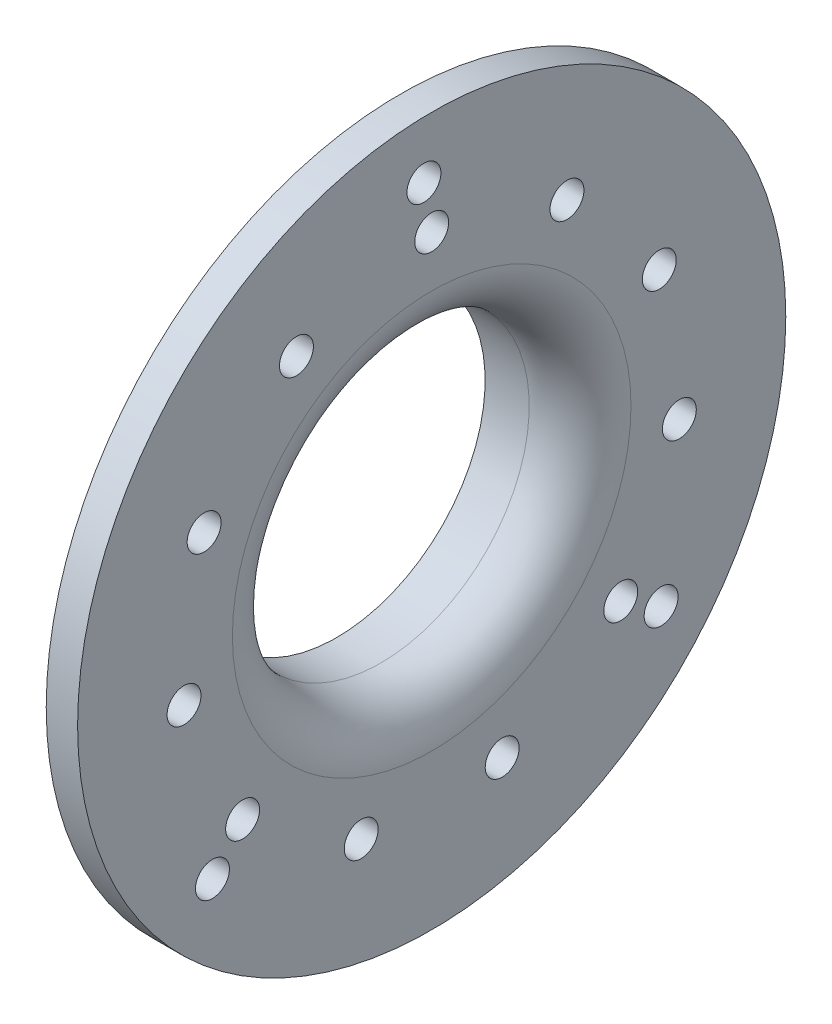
ISO-10303-21;
HEADER;
FILE_DESCRIPTION(('STEP AP214'),'2;1');
FILE_NAME('part.step','',(''),(''),'','','');
FILE_SCHEMA(('AUTOMOTIVE_DESIGN { 1 0 10303 214 1 1 1 1 }'));
ENDSEC;
DATA;
#1=APPLICATION_CONTEXT('core data for automotive mechanical design processes');
#2=APPLICATION_PROTOCOL_DEFINITION('international standard','automotive_design',2000,#1);
#3=PRODUCT_CONTEXT('',#1,'mechanical');
#4=PRODUCT('Part','Part','',(#3));
#5=PRODUCT_RELATED_PRODUCT_CATEGORY('part','',(#4));
#6=PRODUCT_DEFINITION_FORMATION('','',#4);
#7=PRODUCT_DEFINITION_CONTEXT('part definition',#1,'design');
#8=PRODUCT_DEFINITION('design','',#6,#7);
#9=PRODUCT_DEFINITION_SHAPE('','',#8);
#10=(LENGTH_UNIT() NAMED_UNIT(*) SI_UNIT(.MILLI.,.METRE.));
#11=(NAMED_UNIT(*) PLANE_ANGLE_UNIT() SI_UNIT($,.RADIAN.));
#12=(NAMED_UNIT(*) SI_UNIT($,.STERADIAN.) SOLID_ANGLE_UNIT());
#13=UNCERTAINTY_MEASURE_WITH_UNIT(LENGTH_MEASURE(1.E-05),#10,'distance_accuracy_value','');
#14=(GEOMETRIC_REPRESENTATION_CONTEXT(3) GLOBAL_UNCERTAINTY_ASSIGNED_CONTEXT((#13)) GLOBAL_UNIT_ASSIGNED_CONTEXT((#10,
#11,#12)) REPRESENTATION_CONTEXT('',''));
#15=CARTESIAN_POINT('',(0.,0.,0.));
#16=DIRECTION('',(0.,0.,1.));
#17=DIRECTION('',(1.,0.,0.));
#18=AXIS2_PLACEMENT_3D('',#15,#16,#17);
#19=CARTESIAN_POINT('',(-11.2,20.2,0.));
#20=DIRECTION('',(1.,0.,0.));
#21=DIRECTION('',(0.,0.,-1.));
#22=AXIS2_PLACEMENT_3D('',#19,#20,#21);
#23=PLANE('',#22);
#24=CARTESIAN_POINT('',(-11.2,0.,0.));
#25=DIRECTION('',(-1.,0.,0.));
#26=DIRECTION('',(0.,0.,1.));
#27=AXIS2_PLACEMENT_3D('',#24,#25,#26);
#28=CIRCLE('',#27,17.5);
#29=CARTESIAN_POINT('',(-11.2,0.,17.5));
#30=VERTEX_POINT('',#29);
#31=EDGE_CURVE('E72',#30,#30,#28,.T.);
#32=ORIENTED_EDGE('',*,*,#31,.F.);
#33=EDGE_LOOP('',(#32));
#34=FACE_BOUND('',#33,.T.);
#35=CARTESIAN_POINT('',(-11.2,0.,0.));
#36=DIRECTION('',(-1.,0.,0.));
#37=DIRECTION('',(0.,0.,1.));
#38=AXIS2_PLACEMENT_3D('',#35,#36,#37);
#39=CIRCLE('',#38,20.2);
#40=CARTESIAN_POINT('',(-11.2,0.,20.2));
#41=VERTEX_POINT('',#40);
#42=EDGE_CURVE('E10',#41,#41,#39,.T.);
#43=ORIENTED_EDGE('',*,*,#42,.T.);
#44=EDGE_LOOP('',(#43));
#45=FACE_BOUND('',#44,.T.);
#46=ADVANCED_FACE('F31',(#34,#45),#23,.F.);
#47=CARTESIAN_POINT('',(-35.8072240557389,0.,0.));
#48=DIRECTION('',(-1.,0.,0.));
#49=DIRECTION('',(0.,0.,1.));
#50=AXIS2_PLACEMENT_3D('',#47,#48,#49);
#51=CYLINDRICAL_SURFACE('',#50,20.2);
#52=ORIENTED_EDGE('',*,*,#42,.F.);
#53=EDGE_LOOP('',(#52));
#54=FACE_BOUND('',#53,.T.);
#55=CARTESIAN_POINT('',(-8.45,0.,0.));
#56=DIRECTION('',(-1.,0.,0.));
#57=DIRECTION('',(0.,0.,1.));
#58=AXIS2_PLACEMENT_3D('',#55,#56,#57);
#59=CIRCLE('',#58,20.2);
#60=CARTESIAN_POINT('',(-8.45,0.,20.2));
#61=VERTEX_POINT('',#60);
#62=EDGE_CURVE('E37',#61,#61,#59,.T.);
#63=ORIENTED_EDGE('',*,*,#62,.T.);
#64=EDGE_LOOP('',(#63));
#65=FACE_BOUND('',#64,.T.);
#66=ADVANCED_FACE('F212',(#54,#65),#51,.T.);
#67=CARTESIAN_POINT('',(-8.45,19.2,0.));
#68=DIRECTION('',(-1.,0.,0.));
#69=DIRECTION('',(0.,0.,1.));
#70=AXIS2_PLACEMENT_3D('',#67,#68,#69);
#71=PLANE('',#70);
#72=ORIENTED_EDGE('',*,*,#62,.F.);
#73=EDGE_LOOP('',(#72));
#74=FACE_BOUND('',#73,.T.);
#75=CARTESIAN_POINT('',(-8.45,0.,0.));
#76=DIRECTION('',(-1.,0.,0.));
#77=DIRECTION('',(0.,0.,1.));
#78=AXIS2_PLACEMENT_3D('',#75,#76,#77);
#79=CIRCLE('',#78,19.2);
#80=CARTESIAN_POINT('',(-8.45,0.,19.2));
#81=VERTEX_POINT('',#80);
#82=EDGE_CURVE('E41',#81,#81,#79,.T.);
#83=ORIENTED_EDGE('',*,*,#82,.T.);
#84=EDGE_LOOP('',(#83));
#85=FACE_BOUND('',#84,.T.);
#86=ADVANCED_FACE('F216',(#74,#85),#71,.F.);
#87=CARTESIAN_POINT('',(-35.8072240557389,0.,0.));
#88=DIRECTION('',(-1.,0.,0.));
#89=DIRECTION('',(0.,0.,1.));
#90=AXIS2_PLACEMENT_3D('',#87,#88,#89);
#91=CYLINDRICAL_SURFACE('',#90,19.2);
#92=ORIENTED_EDGE('',*,*,#82,.F.);
#93=EDGE_LOOP('',(#92));
#94=FACE_BOUND('',#93,.T.);
#95=CARTESIAN_POINT('',(-7.45,0.,0.));
#96=DIRECTION('',(-1.,0.,0.));
#97=DIRECTION('',(0.,0.,1.));
#98=AXIS2_PLACEMENT_3D('',#95,#96,#97);
#99=CIRCLE('',#98,19.2);
#100=CARTESIAN_POINT('',(-7.45,0.,19.2));
#101=VERTEX_POINT('',#100);
#102=EDGE_CURVE('E45',#101,#101,#99,.T.);
#103=ORIENTED_EDGE('',*,*,#102,.T.);
#104=EDGE_LOOP('',(#103));
#105=FACE_BOUND('',#104,.T.);
#106=ADVANCED_FACE('F221',(#94,#105),#91,.T.);
#107=CARTESIAN_POINT('',(-7.45,20.2,0.));
#108=DIRECTION('',(1.,0.,0.));
#109=DIRECTION('',(0.,0.,-1.));
#110=AXIS2_PLACEMENT_3D('',#107,#108,#109);
#111=PLANE('',#110);
#112=ORIENTED_EDGE('',*,*,#102,.F.);
#113=EDGE_LOOP('',(#112));
#114=FACE_BOUND('',#113,.T.);
#115=CARTESIAN_POINT('',(-7.45,0.,0.));
#116=DIRECTION('',(-1.,0.,0.));
#117=DIRECTION('',(0.,0.,1.));
#118=AXIS2_PLACEMENT_3D('',#115,#116,#117);
#119=CIRCLE('',#118,20.2);
#120=CARTESIAN_POINT('',(-7.45,0.,20.2));
#121=VERTEX_POINT('',#120);
#122=EDGE_CURVE('E50',#121,#121,#119,.T.);
#123=ORIENTED_EDGE('',*,*,#122,.T.);
#124=EDGE_LOOP('',(#123));
#125=FACE_BOUND('',#124,.T.);
#126=ADVANCED_FACE('F227',(#114,#125),#111,.F.);
#127=CARTESIAN_POINT('',(-35.8072240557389,0.,0.));
#128=DIRECTION('',(-1.,0.,0.));
#129=DIRECTION('',(0.,0.,1.));
#130=AXIS2_PLACEMENT_3D('',#127,#128,#129);
#131=CYLINDRICAL_SURFACE('',#130,20.2);
#132=ORIENTED_EDGE('',*,*,#122,.F.);
#133=EDGE_LOOP('',(#132));
#134=FACE_BOUND('',#133,.T.);
#135=CARTESIAN_POINT('',(-5.70000000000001,0.,0.));
#136=DIRECTION('',(-1.,0.,0.));
#137=DIRECTION('',(0.,0.,1.));
#138=AXIS2_PLACEMENT_3D('',#135,#136,#137);
#139=CIRCLE('',#138,20.2);
#140=CARTESIAN_POINT('',(-5.70000000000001,0.,20.2));
#141=VERTEX_POINT('',#140);
#142=EDGE_CURVE('E53',#141,#141,#139,.T.);
#143=ORIENTED_EDGE('',*,*,#142,.T.);
#144=EDGE_LOOP('',(#143));
#145=FACE_BOUND('',#144,.T.);
#146=ADVANCED_FACE('F231',(#134,#145),#131,.T.);
#147=CARTESIAN_POINT('',(-5.7,0.,0.));
#148=DIRECTION('',(-1.,0.,0.));
#149=DIRECTION('',(0.,0.,1.));
#150=AXIS2_PLACEMENT_3D('',#147,#148,#149);
#151=TOROIDAL_SURFACE('',#150,22.2,2.);
#152=ORIENTED_EDGE('',*,*,#142,.F.);
#153=EDGE_LOOP('',(#152));
#154=FACE_BOUND('',#153,.T.);
#155=CARTESIAN_POINT('',(-3.69999999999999,0.,0.));
#156=DIRECTION('',(-1.,0.,0.));
#157=DIRECTION('',(0.,0.,1.));
#158=AXIS2_PLACEMENT_3D('',#155,#156,#157);
#159=CIRCLE('',#158,22.2);
#160=CARTESIAN_POINT('',(-3.69999999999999,0.,22.2));
#161=VERTEX_POINT('',#160);
#162=EDGE_CURVE('E56',#161,#161,#159,.T.);
#163=ORIENTED_EDGE('',*,*,#162,.T.);
#164=EDGE_LOOP('',(#163));
#165=FACE_BOUND('',#164,.T.);
#166=ADVANCED_FACE('F235',(#154,#165),#151,.F.);
#167=CARTESIAN_POINT('',(-3.7,41.75,0.));
#168=DIRECTION('',(1.,0.,0.));
#169=DIRECTION('',(0.,0.,-1.));
#170=AXIS2_PLACEMENT_3D('',#167,#168,#169);
#171=PLANE('',#170);
#172=CARTESIAN_POINT('',(-3.7,-23.6127756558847,25.8510504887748));
#173=DIRECTION('',(1.,0.,0.));
#174=DIRECTION('',(0.,0.,-1.));
#175=AXIS2_PLACEMENT_3D('',#172,#173,#174);
#176=CIRCLE('',#175,2.);
#177=CARTESIAN_POINT('',(-3.7,-23.6127756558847,23.8510504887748));
#178=VERTEX_POINT('',#177);
#179=EDGE_CURVE('E153',#178,#178,#176,.T.);
#180=ORIENTED_EDGE('',*,*,#179,.T.);
#181=EDGE_LOOP('',(#180));
#182=FACE_BOUND('',#181,.T.);
#183=CARTESIAN_POINT('',(-3.7,-22.2274757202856,-27.051419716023));
#184=DIRECTION('',(1.,0.,0.));
#185=DIRECTION('',(0.,0.,-1.));
#186=AXIS2_PLACEMENT_3D('',#183,#184,#185);
#187=CIRCLE('',#186,2.);
#188=CARTESIAN_POINT('',(-3.7,-22.2274757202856,-29.051419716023));
#189=VERTEX_POINT('',#188);
#190=EDGE_CURVE('E147',#189,#189,#187,.T.);
#191=ORIENTED_EDGE('',*,*,#190,.T.);
#192=EDGE_LOOP('',(#191));
#193=FACE_BOUND('',#192,.T.);
#194=CARTESIAN_POINT('',(-3.7,35.,0.916507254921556));
#195=DIRECTION('',(1.,0.,0.));
#196=DIRECTION('',(0.,0.,-1.));
#197=AXIS2_PLACEMENT_3D('',#194,#195,#196);
#198=CIRCLE('',#197,2.);
#199=CARTESIAN_POINT('',(-3.7,35.,-1.08349274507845));
#200=VERTEX_POINT('',#199);
#201=EDGE_CURVE('E141',#200,#200,#198,.T.);
#202=ORIENTED_EDGE('',*,*,#201,.T.);
#203=EDGE_LOOP('',(#202));
#204=FACE_BOUND('',#203,.T.);
#205=CARTESIAN_POINT('',(-3.7,24.8169792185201,15.9489041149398));
#206=DIRECTION('',(1.,0.,0.));
#207=DIRECTION('',(0.,0.,-1.));
#208=AXIS2_PLACEMENT_3D('',#205,#206,#207);
#209=CIRCLE('',#208,2.);
#210=CARTESIAN_POINT('',(-3.7,24.8169792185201,13.9489041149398));
#211=VERTEX_POINT('',#210);
#212=EDGE_CURVE('E135',#211,#211,#209,.T.);
#213=ORIENTED_EDGE('',*,*,#212,.T.);
#214=EDGE_LOOP('',(#213));
#215=FACE_BOUND('',#214,.T.);
#216=CARTESIAN_POINT('',(-3.7,12.254742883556,26.8341438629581));
#217=DIRECTION('',(1.,0.,0.));
#218=DIRECTION('',(0.,0.,-1.));
#219=AXIS2_PLACEMENT_3D('',#216,#217,#218);
#220=CIRCLE('',#219,2.);
#221=CARTESIAN_POINT('',(-3.7,12.254742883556,24.8341438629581));
#222=VERTEX_POINT('',#221);
#223=EDGE_CURVE('E129',#222,#222,#220,.T.);
#224=ORIENTED_EDGE('',*,*,#223,.T.);
#225=EDGE_LOOP('',(#224));
#226=FACE_BOUND('',#225,.T.);
#227=CARTESIAN_POINT('',(-3.7,-4.1982877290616,29.1997325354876));
#228=DIRECTION('',(1.,0.,0.));
#229=DIRECTION('',(0.,0.,-1.));
#230=AXIS2_PLACEMENT_3D('',#227,#228,#229);
#231=CIRCLE('',#230,2.);
#232=CARTESIAN_POINT('',(-3.7,-4.1982877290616,27.1997325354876));
#233=VERTEX_POINT('',#232);
#234=EDGE_CURVE('E123',#233,#233,#231,.T.);
#235=ORIENTED_EDGE('',*,*,#234,.T.);
#236=EDGE_LOOP('',(#235));
#237=FACE_BOUND('',#236,.T.);
#238=CARTESIAN_POINT('',(-3.7,-19.3183916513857,22.2946124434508));
#239=DIRECTION('',(1.,0.,0.));
#240=DIRECTION('',(0.,0.,-1.));
#241=AXIS2_PLACEMENT_3D('',#238,#239,#240);
#242=CIRCLE('',#241,2.);
#243=CARTESIAN_POINT('',(-3.7,-19.3183916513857,20.2946124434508));
#244=VERTEX_POINT('',#243);
#245=EDGE_CURVE('E117',#244,#244,#242,.T.);
#246=ORIENTED_EDGE('',*,*,#245,.T.);
#247=EDGE_LOOP('',(#246));
#248=FACE_BOUND('',#247,.T.);
#249=CARTESIAN_POINT('',(-3.7,-28.3050427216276,8.31111042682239));
#250=DIRECTION('',(1.,0.,0.));
#251=DIRECTION('',(0.,0.,-1.));
#252=AXIS2_PLACEMENT_3D('',#249,#250,#251);
#253=CIRCLE('',#252,2.);
#254=CARTESIAN_POINT('',(-3.7,-28.3050427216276,6.31111042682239));
#255=VERTEX_POINT('',#254);
#256=EDGE_CURVE('E111',#255,#255,#253,.T.);
#257=ORIENTED_EDGE('',*,*,#256,.T.);
#258=EDGE_LOOP('',(#257));
#259=FACE_BOUND('',#258,.T.);
#260=CARTESIAN_POINT('',(-3.7,-28.3050427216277,-8.31111042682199));
#261=DIRECTION('',(1.,0.,0.));
#262=DIRECTION('',(0.,0.,-1.));
#263=AXIS2_PLACEMENT_3D('',#260,#261,#262);
#264=CIRCLE('',#263,2.);
#265=CARTESIAN_POINT('',(-3.7,-28.3050427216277,-10.311110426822));
#266=VERTEX_POINT('',#265);
#267=EDGE_CURVE('E105',#266,#266,#264,.T.);
#268=ORIENTED_EDGE('',*,*,#267,.T.);
#269=EDGE_LOOP('',(#268));
#270=FACE_BOUND('',#269,.T.);
#271=CARTESIAN_POINT('',(-3.7,-19.318391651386,-22.2946124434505));
#272=DIRECTION('',(1.,0.,0.));
#273=DIRECTION('',(0.,0.,-1.));
#274=AXIS2_PLACEMENT_3D('',#271,#272,#273);
#275=CIRCLE('',#274,2.);
#276=CARTESIAN_POINT('',(-3.7,-19.318391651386,-24.2946124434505));
#277=VERTEX_POINT('',#276);
#278=EDGE_CURVE('E99',#277,#277,#275,.T.);
#279=ORIENTED_EDGE('',*,*,#278,.T.);
#280=EDGE_LOOP('',(#279));
#281=FACE_BOUND('',#280,.T.);
#282=CARTESIAN_POINT('',(-3.7,-4.19828772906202,-29.1997325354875));
#283=DIRECTION('',(1.,0.,0.));
#284=DIRECTION('',(0.,0.,-1.));
#285=AXIS2_PLACEMENT_3D('',#282,#283,#284);
#286=CIRCLE('',#285,2.);
#287=CARTESIAN_POINT('',(-3.7,-4.19828772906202,-31.1997325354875));
#288=VERTEX_POINT('',#287);
#289=EDGE_CURVE('E93',#288,#288,#286,.T.);
#290=ORIENTED_EDGE('',*,*,#289,.T.);
#291=EDGE_LOOP('',(#290));
#292=FACE_BOUND('',#291,.T.);
#293=CARTESIAN_POINT('',(-3.7,12.2547428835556,-26.8341438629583));
#294=DIRECTION('',(1.,0.,0.));
#295=DIRECTION('',(0.,0.,-1.));
#296=AXIS2_PLACEMENT_3D('',#293,#294,#295);
#297=CIRCLE('',#296,2.);
#298=CARTESIAN_POINT('',(-3.7,12.2547428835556,-28.8341438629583));
#299=VERTEX_POINT('',#298);
#300=EDGE_CURVE('E87',#299,#299,#297,.T.);
#301=ORIENTED_EDGE('',*,*,#300,.T.);
#302=EDGE_LOOP('',(#301));
#303=FACE_BOUND('',#302,.T.);
#304=CARTESIAN_POINT('',(-3.7,24.8169792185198,-15.9489041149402));
#305=DIRECTION('',(1.,0.,0.));
#306=DIRECTION('',(0.,0.,-1.));
#307=AXIS2_PLACEMENT_3D('',#304,#305,#306);
#308=CIRCLE('',#307,2.);
#309=CARTESIAN_POINT('',(-3.7,24.8169792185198,-17.9489041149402));
#310=VERTEX_POINT('',#309);
#311=EDGE_CURVE('E81',#310,#310,#308,.T.);
#312=ORIENTED_EDGE('',*,*,#311,.T.);
#313=EDGE_LOOP('',(#312));
#314=FACE_BOUND('',#313,.T.);
#315=CARTESIAN_POINT('',(-3.7,29.5,0.));
#316=DIRECTION('',(1.,0.,0.));
#317=DIRECTION('',(0.,0.,-1.));
#318=AXIS2_PLACEMENT_3D('',#315,#316,#317);
#319=CIRCLE('',#318,2.);
#320=CARTESIAN_POINT('',(-3.7,29.5,-2.));
#321=VERTEX_POINT('',#320);
#322=EDGE_CURVE('E75',#321,#321,#319,.T.);
#323=ORIENTED_EDGE('',*,*,#322,.T.);
#324=EDGE_LOOP('',(#323));
#325=FACE_BOUND('',#324,.T.);
#326=ORIENTED_EDGE('',*,*,#162,.F.);
#327=EDGE_LOOP('',(#326));
#328=FACE_BOUND('',#327,.T.);
#329=CARTESIAN_POINT('',(-3.7,0.,0.));
#330=DIRECTION('',(-1.,0.,0.));
#331=DIRECTION('',(0.,0.,1.));
#332=AXIS2_PLACEMENT_3D('',#329,#330,#331);
#333=CIRCLE('',#332,41.75);
#334=CARTESIAN_POINT('',(-3.7,0.,41.75));
#335=VERTEX_POINT('',#334);
#336=EDGE_CURVE('E59',#335,#335,#333,.T.);
#337=ORIENTED_EDGE('',*,*,#336,.T.);
#338=EDGE_LOOP('',(#337));
#339=FACE_BOUND('',#338,.T.);
#340=ADVANCED_FACE('F239',(#182,#193,#204,#215,#226,#237,#248,#259,#270,#281,#292,#303,#314,
#325,#328,#339),#171,.F.);
#341=CARTESIAN_POINT('',(-35.8072240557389,0.,0.));
#342=DIRECTION('',(-1.,0.,0.));
#343=DIRECTION('',(0.,0.,1.));
#344=AXIS2_PLACEMENT_3D('',#341,#342,#343);
#345=CYLINDRICAL_SURFACE('',#344,41.75);
#346=ORIENTED_EDGE('',*,*,#336,.F.);
#347=EDGE_LOOP('',(#346));
#348=FACE_BOUND('',#347,.T.);
#349=CARTESIAN_POINT('',(0.,0.,0.));
#350=DIRECTION('',(-1.,0.,0.));
#351=DIRECTION('',(0.,0.,1.));
#352=AXIS2_PLACEMENT_3D('',#349,#350,#351);
#353=CIRCLE('',#352,41.75);
#354=CARTESIAN_POINT('',(0.,0.,41.75));
#355=VERTEX_POINT('',#354);
#356=EDGE_CURVE('E63',#355,#355,#353,.T.);
#357=ORIENTED_EDGE('',*,*,#356,.T.);
#358=EDGE_LOOP('',(#357));
#359=FACE_BOUND('',#358,.T.);
#360=ADVANCED_FACE('F167',(#348,#359),#345,.T.);
#361=CARTESIAN_POINT('',(0.,23.5,0.));
#362=DIRECTION('',(-1.,0.,0.));
#363=DIRECTION('',(0.,0.,1.));
#364=AXIS2_PLACEMENT_3D('',#361,#362,#363);
#365=PLANE('',#364);
#366=CARTESIAN_POINT('',(0.,-23.6127756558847,25.8510504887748));
#367=DIRECTION('',(1.,0.,0.));
#368=DIRECTION('',(0.,0.755749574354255,0.654860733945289));
#369=AXIS2_PLACEMENT_3D('',#366,#367,#368);
#370=CIRCLE('',#369,2.);
#371=CARTESIAN_POINT('',(0.,-22.1012765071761,27.1607719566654));
#372=VERTEX_POINT('',#371);
#373=EDGE_CURVE('E156',#372,#372,#370,.T.);
#374=ORIENTED_EDGE('',*,*,#373,.F.);
#375=EDGE_LOOP('',(#374));
#376=FACE_BOUND('',#375,.T.);
#377=CARTESIAN_POINT('',(0.,-22.2274757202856,-27.051419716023));
#378=DIRECTION('',(1.,0.,0.));
#379=DIRECTION('',(0.,-0.755749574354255,0.654860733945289));
#380=AXIS2_PLACEMENT_3D('',#377,#378,#379);
#381=CIRCLE('',#380,2.);
#382=CARTESIAN_POINT('',(0.,-23.7389748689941,-25.7416982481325));
#383=VERTEX_POINT('',#382);
#384=EDGE_CURVE('E150',#383,#383,#381,.T.);
#385=ORIENTED_EDGE('',*,*,#384,.F.);
#386=EDGE_LOOP('',(#385));
#387=FACE_BOUND('',#386,.T.);
#388=CARTESIAN_POINT('',(0.,35.,0.916507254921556));
#389=DIRECTION('',(1.,0.,0.));
#390=DIRECTION('',(0.,0.,-1.));
#391=AXIS2_PLACEMENT_3D('',#388,#389,#390);
#392=CIRCLE('',#391,2.);
#393=CARTESIAN_POINT('',(0.,35.,-1.08349274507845));
#394=VERTEX_POINT('',#393);
#395=EDGE_CURVE('E144',#394,#394,#392,.T.);
#396=ORIENTED_EDGE('',*,*,#395,.F.);
#397=EDGE_LOOP('',(#396));
#398=FACE_BOUND('',#397,.T.);
#399=CARTESIAN_POINT('',(0.,24.8169792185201,15.9489041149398));
#400=DIRECTION('',(1.,0.,0.));
#401=DIRECTION('',(0.,0.540640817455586,-0.841253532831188));
#402=AXIS2_PLACEMENT_3D('',#399,#400,#401);
#403=CIRCLE('',#402,2.);
#404=CARTESIAN_POINT('',(0.,25.8982608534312,14.2663970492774));
#405=VERTEX_POINT('',#404);
#406=EDGE_CURVE('E138',#405,#405,#403,.T.);
#407=ORIENTED_EDGE('',*,*,#406,.F.);
#408=EDGE_LOOP('',(#407));
#409=FACE_BOUND('',#408,.T.);
#410=CARTESIAN_POINT('',(0.,12.254742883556,26.8341438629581));
#411=DIRECTION('',(1.,0.,0.));
#412=DIRECTION('',(0.,0.909631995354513,-0.415415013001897));
#413=AXIS2_PLACEMENT_3D('',#410,#411,#412);
#414=CIRCLE('',#413,2.);
#415=CARTESIAN_POINT('',(0.,14.074006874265,26.0033138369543));
#416=VERTEX_POINT('',#415);
#417=EDGE_CURVE('E132',#416,#416,#414,.T.);
#418=ORIENTED_EDGE('',*,*,#417,.F.);
#419=EDGE_LOOP('',(#418));
#420=FACE_BOUND('',#419,.T.);
#421=CARTESIAN_POINT('',(0.,-4.1982877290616,29.1997325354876));
#422=DIRECTION('',(1.,0.,0.));
#423=DIRECTION('',(0.,0.989821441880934,0.142314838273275));
#424=AXIS2_PLACEMENT_3D('',#421,#422,#423);
#425=CIRCLE('',#424,2.);
#426=CARTESIAN_POINT('',(0.,-2.21864484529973,29.4843622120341));
#427=VERTEX_POINT('',#426);
#428=EDGE_CURVE('E126',#427,#427,#425,.T.);
#429=ORIENTED_EDGE('',*,*,#428,.F.);
#430=EDGE_LOOP('',(#429));
#431=FACE_BOUND('',#430,.T.);
#432=CARTESIAN_POINT('',(0.,-19.3183916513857,22.2946124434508));
#433=DIRECTION('',(1.,0.,0.));
#434=DIRECTION('',(0.,0.755749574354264,0.654860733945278));
#435=AXIS2_PLACEMENT_3D('',#432,#433,#434);
#436=CIRCLE('',#435,2.);
#437=CARTESIAN_POINT('',(0.,-17.8068925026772,23.6043339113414));
#438=VERTEX_POINT('',#437);
#439=EDGE_CURVE('E120',#438,#438,#436,.T.);
#440=ORIENTED_EDGE('',*,*,#439,.F.);
#441=EDGE_LOOP('',(#440));
#442=FACE_BOUND('',#441,.T.);
#443=CARTESIAN_POINT('',(0.,-28.3050427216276,8.31111042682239));
#444=DIRECTION('',(1.,0.,0.));
#445=DIRECTION('',(0.,0.281732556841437,0.959492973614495));
#446=AXIS2_PLACEMENT_3D('',#443,#444,#445);
#447=CIRCLE('',#446,2.);
#448=CARTESIAN_POINT('',(0.,-27.7415776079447,10.2300963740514));
#449=VERTEX_POINT('',#448);
#450=EDGE_CURVE('E114',#449,#449,#447,.T.);
#451=ORIENTED_EDGE('',*,*,#450,.F.);
#452=EDGE_LOOP('',(#451));
#453=FACE_BOUND('',#452,.T.);
#454=CARTESIAN_POINT('',(0.,-28.3050427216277,-8.31111042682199));
#455=DIRECTION('',(1.,0.,0.));
#456=DIRECTION('',(0.,-0.281732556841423,0.959492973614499));
#457=AXIS2_PLACEMENT_3D('',#454,#455,#456);
#458=CIRCLE('',#457,2.);
#459=CARTESIAN_POINT('',(0.,-28.8685078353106,-6.39212447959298));
#460=VERTEX_POINT('',#459);
#461=EDGE_CURVE('E108',#460,#460,#458,.T.);
#462=ORIENTED_EDGE('',*,*,#461,.F.);
#463=EDGE_LOOP('',(#462));
#464=FACE_BOUND('',#463,.T.);
#465=CARTESIAN_POINT('',(0.,-19.318391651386,-22.2946124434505));
#466=DIRECTION('',(1.,0.,0.));
#467=DIRECTION('',(0.,-0.755749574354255,0.654860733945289));
#468=AXIS2_PLACEMENT_3D('',#465,#466,#467);
#469=CIRCLE('',#468,2.);
#470=CARTESIAN_POINT('',(0.,-20.8298908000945,-20.9848909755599));
#471=VERTEX_POINT('',#470);
#472=EDGE_CURVE('E102',#471,#471,#469,.T.);
#473=ORIENTED_EDGE('',*,*,#472,.F.);
#474=EDGE_LOOP('',(#473));
#475=FACE_BOUND('',#474,.T.);
#476=CARTESIAN_POINT('',(0.,-4.19828772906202,-29.1997325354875));
#477=DIRECTION('',(1.,0.,0.));
#478=DIRECTION('',(0.,-0.989821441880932,0.142314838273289));
#479=AXIS2_PLACEMENT_3D('',#476,#477,#478);
#480=CIRCLE('',#479,2.);
#481=CARTESIAN_POINT('',(0.,-6.17793061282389,-28.9151028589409));
#482=VERTEX_POINT('',#481);
#483=EDGE_CURVE('E96',#482,#482,#480,.T.);
#484=ORIENTED_EDGE('',*,*,#483,.F.);
#485=EDGE_LOOP('',(#484));
#486=FACE_BOUND('',#485,.T.);
#487=CARTESIAN_POINT('',(0.,12.2547428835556,-26.8341438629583));
#488=DIRECTION('',(1.,0.,0.));
#489=DIRECTION('',(0.,-0.909631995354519,-0.415415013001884));
#490=AXIS2_PLACEMENT_3D('',#487,#488,#489);
#491=CIRCLE('',#490,2.);
#492=CARTESIAN_POINT('',(0.,10.4354788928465,-27.6649738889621));
#493=VERTEX_POINT('',#492);
#494=EDGE_CURVE('E90',#493,#493,#491,.T.);
#495=ORIENTED_EDGE('',*,*,#494,.F.);
#496=EDGE_LOOP('',(#495));
#497=FACE_BOUND('',#496,.T.);
#498=CARTESIAN_POINT('',(0.,24.8169792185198,-15.9489041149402));
#499=DIRECTION('',(1.,0.,0.));
#500=DIRECTION('',(0.,-0.540640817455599,-0.841253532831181));
#501=AXIS2_PLACEMENT_3D('',#498,#499,#500);
#502=CIRCLE('',#501,2.);
#503=CARTESIAN_POINT('',(0.,23.7356975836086,-17.6314111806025));
#504=VERTEX_POINT('',#503);
#505=EDGE_CURVE('E84',#504,#504,#502,.T.);
#506=ORIENTED_EDGE('',*,*,#505,.F.);
#507=EDGE_LOOP('',(#506));
#508=FACE_BOUND('',#507,.T.);
#509=CARTESIAN_POINT('',(0.,29.5,0.));
#510=DIRECTION('',(1.,0.,0.));
#511=DIRECTION('',(0.,0.,-1.));
#512=AXIS2_PLACEMENT_3D('',#509,#510,#511);
#513=CIRCLE('',#512,2.);
#514=CARTESIAN_POINT('',(0.,29.5,-2.));
#515=VERTEX_POINT('',#514);
#516=EDGE_CURVE('E78',#515,#515,#513,.T.);
#517=ORIENTED_EDGE('',*,*,#516,.F.);
#518=EDGE_LOOP('',(#517));
#519=FACE_BOUND('',#518,.T.);
#520=ORIENTED_EDGE('',*,*,#356,.F.);
#521=EDGE_LOOP('',(#520));
#522=FACE_BOUND('',#521,.T.);
#523=CARTESIAN_POINT('',(0.,0.,0.));
#524=DIRECTION('',(-1.,0.,0.));
#525=DIRECTION('',(0.,0.,1.));
#526=AXIS2_PLACEMENT_3D('',#523,#524,#525);
#527=CIRCLE('',#526,23.5);
#528=CARTESIAN_POINT('',(0.,0.,23.5));
#529=VERTEX_POINT('',#528);
#530=EDGE_CURVE('E66',#529,#529,#527,.T.);
#531=ORIENTED_EDGE('',*,*,#530,.T.);
#532=EDGE_LOOP('',(#531));
#533=FACE_BOUND('',#532,.T.);
#534=ADVANCED_FACE('F163',(#376,#387,#398,#409,#420,#431,#442,#453,#464,#475,#486,#497,#508,
#519,#522,#533),#365,.F.);
#535=CARTESIAN_POINT('',(-6.,0.,0.));
#536=DIRECTION('',(-1.,0.,0.));
#537=DIRECTION('',(0.,0.,1.));
#538=AXIS2_PLACEMENT_3D('',#535,#536,#537);
#539=TOROIDAL_SURFACE('',#538,23.5,6.);
#540=ORIENTED_EDGE('',*,*,#530,.F.);
#541=EDGE_LOOP('',(#540));
#542=FACE_BOUND('',#541,.T.);
#543=CARTESIAN_POINT('',(-6.,0.,0.));
#544=DIRECTION('',(-1.,0.,0.));
#545=DIRECTION('',(0.,0.,1.));
#546=AXIS2_PLACEMENT_3D('',#543,#544,#545);
#547=CIRCLE('',#546,17.5);
#548=CARTESIAN_POINT('',(-6.,0.,17.5));
#549=VERTEX_POINT('',#548);
#550=EDGE_CURVE('E69',#549,#549,#547,.T.);
#551=ORIENTED_EDGE('',*,*,#550,.T.);
#552=EDGE_LOOP('',(#551));
#553=FACE_BOUND('',#552,.T.);
#554=ADVANCED_FACE('F166',(#542,#553),#539,.T.);
#555=CARTESIAN_POINT('',(-35.8072240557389,0.,0.));
#556=DIRECTION('',(-1.,0.,0.));
#557=DIRECTION('',(0.,0.,1.));
#558=AXIS2_PLACEMENT_3D('',#555,#556,#557);
#559=CYLINDRICAL_SURFACE('',#558,17.5);
#560=ORIENTED_EDGE('',*,*,#550,.F.);
#561=EDGE_LOOP('',(#560));
#562=FACE_BOUND('',#561,.T.);
#563=ORIENTED_EDGE('',*,*,#31,.T.);
#564=EDGE_LOOP('',(#563));
#565=FACE_BOUND('',#564,.T.);
#566=ADVANCED_FACE('F201',(#562,#565),#559,.F.);
#567=CARTESIAN_POINT('',(-11.2,29.5,0.));
#568=DIRECTION('',(1.,0.,0.));
#569=DIRECTION('',(0.,0.,-1.));
#570=AXIS2_PLACEMENT_3D('',#567,#568,#569);
#571=CYLINDRICAL_SURFACE('',#570,2.);
#572=ORIENTED_EDGE('',*,*,#516,.T.);
#573=EDGE_LOOP('',(#572));
#574=FACE_BOUND('',#573,.T.);
#575=ORIENTED_EDGE('',*,*,#322,.F.);
#576=EDGE_LOOP('',(#575));
#577=FACE_BOUND('',#576,.T.);
#578=ADVANCED_FACE('F207',(#574,#577),#571,.F.);
#579=CARTESIAN_POINT('',(-11.2,24.8169792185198,-15.9489041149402));
#580=DIRECTION('',(1.,0.,0.));
#581=DIRECTION('',(0.,0.,-1.));
#582=AXIS2_PLACEMENT_3D('',#579,#580,#581);
#583=CYLINDRICAL_SURFACE('',#582,2.);
#584=ORIENTED_EDGE('',*,*,#505,.T.);
#585=EDGE_LOOP('',(#584));
#586=FACE_BOUND('',#585,.T.);
#587=ORIENTED_EDGE('',*,*,#311,.F.);
#588=EDGE_LOOP('',(#587));
#589=FACE_BOUND('',#588,.T.);
#590=ADVANCED_FACE('F249',(#586,#589),#583,.F.);
#591=CARTESIAN_POINT('',(-11.2,12.2547428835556,-26.8341438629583));
#592=DIRECTION('',(1.,0.,0.));
#593=DIRECTION('',(0.,0.,-1.));
#594=AXIS2_PLACEMENT_3D('',#591,#592,#593);
#595=CYLINDRICAL_SURFACE('',#594,2.);
#596=ORIENTED_EDGE('',*,*,#494,.T.);
#597=EDGE_LOOP('',(#596));
#598=FACE_BOUND('',#597,.T.);
#599=ORIENTED_EDGE('',*,*,#300,.F.);
#600=EDGE_LOOP('',(#599));
#601=FACE_BOUND('',#600,.T.);
#602=ADVANCED_FACE('F253',(#598,#601),#595,.F.);
#603=CARTESIAN_POINT('',(-11.2,-4.19828772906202,-29.1997325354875));
#604=DIRECTION('',(1.,0.,0.));
#605=DIRECTION('',(0.,0.,-1.));
#606=AXIS2_PLACEMENT_3D('',#603,#604,#605);
#607=CYLINDRICAL_SURFACE('',#606,2.);
#608=ORIENTED_EDGE('',*,*,#483,.T.);
#609=EDGE_LOOP('',(#608));
#610=FACE_BOUND('',#609,.T.);
#611=ORIENTED_EDGE('',*,*,#289,.F.);
#612=EDGE_LOOP('',(#611));
#613=FACE_BOUND('',#612,.T.);
#614=ADVANCED_FACE('F257',(#610,#613),#607,.F.);
#615=CARTESIAN_POINT('',(-11.2,-19.318391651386,-22.2946124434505));
#616=DIRECTION('',(1.,0.,0.));
#617=DIRECTION('',(0.,0.,-1.));
#618=AXIS2_PLACEMENT_3D('',#615,#616,#617);
#619=CYLINDRICAL_SURFACE('',#618,2.);
#620=ORIENTED_EDGE('',*,*,#472,.T.);
#621=EDGE_LOOP('',(#620));
#622=FACE_BOUND('',#621,.T.);
#623=ORIENTED_EDGE('',*,*,#278,.F.);
#624=EDGE_LOOP('',(#623));
#625=FACE_BOUND('',#624,.T.);
#626=ADVANCED_FACE('F261',(#622,#625),#619,.F.);
#627=CARTESIAN_POINT('',(-11.2,-28.3050427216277,-8.31111042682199));
#628=DIRECTION('',(1.,0.,0.));
#629=DIRECTION('',(0.,0.,-1.));
#630=AXIS2_PLACEMENT_3D('',#627,#628,#629);
#631=CYLINDRICAL_SURFACE('',#630,2.);
#632=ORIENTED_EDGE('',*,*,#461,.T.);
#633=EDGE_LOOP('',(#632));
#634=FACE_BOUND('',#633,.T.);
#635=ORIENTED_EDGE('',*,*,#267,.F.);
#636=EDGE_LOOP('',(#635));
#637=FACE_BOUND('',#636,.T.);
#638=ADVANCED_FACE('F265',(#634,#637),#631,.F.);
#639=CARTESIAN_POINT('',(-11.2,-28.3050427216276,8.31111042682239));
#640=DIRECTION('',(1.,0.,0.));
#641=DIRECTION('',(0.,0.,-1.));
#642=AXIS2_PLACEMENT_3D('',#639,#640,#641);
#643=CYLINDRICAL_SURFACE('',#642,2.);
#644=ORIENTED_EDGE('',*,*,#450,.T.);
#645=EDGE_LOOP('',(#644));
#646=FACE_BOUND('',#645,.T.);
#647=ORIENTED_EDGE('',*,*,#256,.F.);
#648=EDGE_LOOP('',(#647));
#649=FACE_BOUND('',#648,.T.);
#650=ADVANCED_FACE('F269',(#646,#649),#643,.F.);
#651=CARTESIAN_POINT('',(-11.2,-19.3183916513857,22.2946124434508));
#652=DIRECTION('',(1.,0.,0.));
#653=DIRECTION('',(0.,0.,-1.));
#654=AXIS2_PLACEMENT_3D('',#651,#652,#653);
#655=CYLINDRICAL_SURFACE('',#654,2.);
#656=ORIENTED_EDGE('',*,*,#439,.T.);
#657=EDGE_LOOP('',(#656));
#658=FACE_BOUND('',#657,.T.);
#659=ORIENTED_EDGE('',*,*,#245,.F.);
#660=EDGE_LOOP('',(#659));
#661=FACE_BOUND('',#660,.T.);
#662=ADVANCED_FACE('F273',(#658,#661),#655,.F.);
#663=CARTESIAN_POINT('',(-11.2,-4.1982877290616,29.1997325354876));
#664=DIRECTION('',(1.,0.,0.));
#665=DIRECTION('',(0.,0.,-1.));
#666=AXIS2_PLACEMENT_3D('',#663,#664,#665);
#667=CYLINDRICAL_SURFACE('',#666,2.);
#668=ORIENTED_EDGE('',*,*,#428,.T.);
#669=EDGE_LOOP('',(#668));
#670=FACE_BOUND('',#669,.T.);
#671=ORIENTED_EDGE('',*,*,#234,.F.);
#672=EDGE_LOOP('',(#671));
#673=FACE_BOUND('',#672,.T.);
#674=ADVANCED_FACE('F277',(#670,#673),#667,.F.);
#675=CARTESIAN_POINT('',(-11.2,12.254742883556,26.8341438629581));
#676=DIRECTION('',(1.,0.,0.));
#677=DIRECTION('',(0.,0.,-1.));
#678=AXIS2_PLACEMENT_3D('',#675,#676,#677);
#679=CYLINDRICAL_SURFACE('',#678,2.);
#680=ORIENTED_EDGE('',*,*,#417,.T.);
#681=EDGE_LOOP('',(#680));
#682=FACE_BOUND('',#681,.T.);
#683=ORIENTED_EDGE('',*,*,#223,.F.);
#684=EDGE_LOOP('',(#683));
#685=FACE_BOUND('',#684,.T.);
#686=ADVANCED_FACE('F281',(#682,#685),#679,.F.);
#687=CARTESIAN_POINT('',(-11.2,24.8169792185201,15.9489041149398));
#688=DIRECTION('',(1.,0.,0.));
#689=DIRECTION('',(0.,0.,-1.));
#690=AXIS2_PLACEMENT_3D('',#687,#688,#689);
#691=CYLINDRICAL_SURFACE('',#690,2.);
#692=ORIENTED_EDGE('',*,*,#406,.T.);
#693=EDGE_LOOP('',(#692));
#694=FACE_BOUND('',#693,.T.);
#695=ORIENTED_EDGE('',*,*,#212,.F.);
#696=EDGE_LOOP('',(#695));
#697=FACE_BOUND('',#696,.T.);
#698=ADVANCED_FACE('F285',(#694,#697),#691,.F.);
#699=CARTESIAN_POINT('',(-11.2,35.,0.916507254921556));
#700=DIRECTION('',(1.,0.,0.));
#701=DIRECTION('',(0.,0.,-1.));
#702=AXIS2_PLACEMENT_3D('',#699,#700,#701);
#703=CYLINDRICAL_SURFACE('',#702,2.);
#704=ORIENTED_EDGE('',*,*,#395,.T.);
#705=EDGE_LOOP('',(#704));
#706=FACE_BOUND('',#705,.T.);
#707=ORIENTED_EDGE('',*,*,#201,.F.);
#708=EDGE_LOOP('',(#707));
#709=FACE_BOUND('',#708,.T.);
#710=ADVANCED_FACE('F289',(#706,#709),#703,.F.);
#711=CARTESIAN_POINT('',(-11.2,-22.2274757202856,-27.051419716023));
#712=DIRECTION('',(1.,0.,0.));
#713=DIRECTION('',(0.,0.,-1.));
#714=AXIS2_PLACEMENT_3D('',#711,#712,#713);
#715=CYLINDRICAL_SURFACE('',#714,2.);
#716=ORIENTED_EDGE('',*,*,#384,.T.);
#717=EDGE_LOOP('',(#716));
#718=FACE_BOUND('',#717,.T.);
#719=ORIENTED_EDGE('',*,*,#190,.F.);
#720=EDGE_LOOP('',(#719));
#721=FACE_BOUND('',#720,.T.);
#722=ADVANCED_FACE('F293',(#718,#721),#715,.F.);
#723=CARTESIAN_POINT('',(-11.2,-23.6127756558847,25.8510504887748));
#724=DIRECTION('',(1.,0.,0.));
#725=DIRECTION('',(0.,0.,-1.));
#726=AXIS2_PLACEMENT_3D('',#723,#724,#725);
#727=CYLINDRICAL_SURFACE('',#726,2.);
#728=ORIENTED_EDGE('',*,*,#373,.T.);
#729=EDGE_LOOP('',(#728));
#730=FACE_BOUND('',#729,.T.);
#731=ORIENTED_EDGE('',*,*,#179,.F.);
#732=EDGE_LOOP('',(#731));
#733=FACE_BOUND('',#732,.T.);
#734=ADVANCED_FACE('F160',(#730,#733),#727,.F.);
#735=CLOSED_SHELL('',(#46,#66,#86,#106,#126,#146,#166,#340,#360,#534,#554,#566,#578,#590,#602,
#614,#626,#638,#650,#662,#674,#686,#698,#710,#722,#734));
#736=MANIFOLD_SOLID_BREP('B2',#735);
#737=ADVANCED_BREP_SHAPE_REPRESENTATION('',(#18,#736),#14);
#738=SHAPE_DEFINITION_REPRESENTATION(#9,#737);
ENDSEC;
END-ISO-10303-21;
